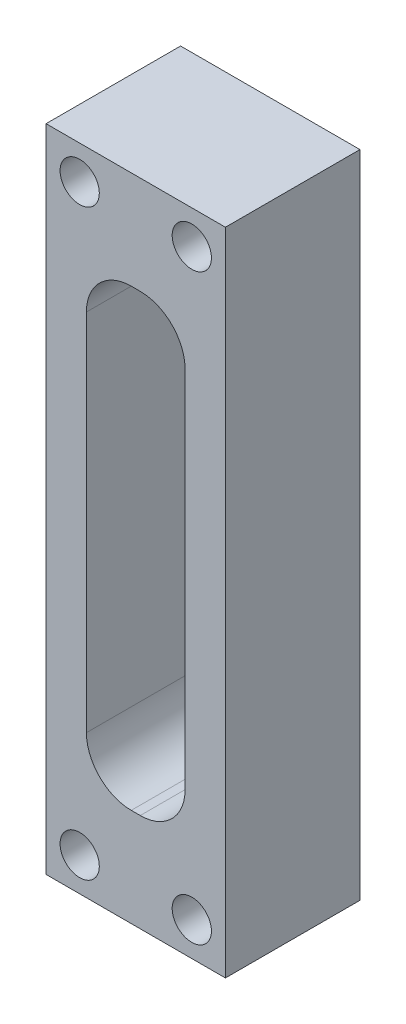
ISO-10303-21;
HEADER;
FILE_DESCRIPTION(('STEP AP214'),'2;1');
FILE_NAME('part.step','',(''),(''),'','','');
FILE_SCHEMA(('AUTOMOTIVE_DESIGN { 1 0 10303 214 1 1 1 1 }'));
ENDSEC;
DATA;
#1=APPLICATION_CONTEXT('core data for automotive mechanical design processes');
#2=APPLICATION_PROTOCOL_DEFINITION('international standard','automotive_design',2000,#1);
#3=PRODUCT_CONTEXT('',#1,'mechanical');
#4=PRODUCT('Part','Part','',(#3));
#5=PRODUCT_RELATED_PRODUCT_CATEGORY('part','',(#4));
#6=PRODUCT_DEFINITION_FORMATION('','',#4);
#7=PRODUCT_DEFINITION_CONTEXT('part definition',#1,'design');
#8=PRODUCT_DEFINITION('design','',#6,#7);
#9=PRODUCT_DEFINITION_SHAPE('','',#8);
#10=(LENGTH_UNIT() NAMED_UNIT(*) SI_UNIT(.MILLI.,.METRE.));
#11=(NAMED_UNIT(*) PLANE_ANGLE_UNIT() SI_UNIT($,.RADIAN.));
#12=(NAMED_UNIT(*) SI_UNIT($,.STERADIAN.) SOLID_ANGLE_UNIT());
#13=UNCERTAINTY_MEASURE_WITH_UNIT(LENGTH_MEASURE(1.E-05),#10,'distance_accuracy_value','');
#14=(GEOMETRIC_REPRESENTATION_CONTEXT(3) GLOBAL_UNCERTAINTY_ASSIGNED_CONTEXT((#13)) GLOBAL_UNIT_ASSIGNED_CONTEXT((#10,
#11,#12)) REPRESENTATION_CONTEXT('',''));
#15=CARTESIAN_POINT('',(0.,0.,0.));
#16=DIRECTION('',(0.,0.,1.));
#17=DIRECTION('',(1.,0.,0.));
#18=AXIS2_PLACEMENT_3D('',#15,#16,#17);
#19=CARTESIAN_POINT('',(-12.7,-46.0375,9.525));
#20=DIRECTION('',(0.,0.,1.));
#21=DIRECTION('',(1.,0.,0.));
#22=AXIS2_PLACEMENT_3D('',#19,#20,#21);
#23=PLANE('',#22);
#24=CARTESIAN_POINT('',(-7.93749999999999,41.275,9.525));
#25=DIRECTION('',(0.,0.,1.));
#26=DIRECTION('',(1.,0.,0.));
#27=AXIS2_PLACEMENT_3D('',#24,#25,#26);
#28=CIRCLE('',#27,2.778125);
#29=CARTESIAN_POINT('',(-5.159375,41.275,9.525));
#30=VERTEX_POINT('',#29);
#31=EDGE_CURVE('E306',#30,#30,#28,.T.);
#32=ORIENTED_EDGE('',*,*,#31,.F.);
#33=EDGE_LOOP('',(#32));
#34=FACE_BOUND('',#33,.T.);
#35=CARTESIAN_POINT('',(7.93750000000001,41.275,9.525));
#36=DIRECTION('',(0.,0.,1.));
#37=DIRECTION('',(1.,0.,0.));
#38=AXIS2_PLACEMENT_3D('',#35,#36,#37);
#39=CIRCLE('',#38,2.778125);
#40=CARTESIAN_POINT('',(10.715625,41.275,9.525));
#41=VERTEX_POINT('',#40);
#42=EDGE_CURVE('E310',#41,#41,#39,.T.);
#43=ORIENTED_EDGE('',*,*,#42,.F.);
#44=EDGE_LOOP('',(#43));
#45=FACE_BOUND('',#44,.T.);
#46=CARTESIAN_POINT('',(7.93750000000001,-41.275,9.525));
#47=DIRECTION('',(0.,0.,1.));
#48=DIRECTION('',(1.,0.,0.));
#49=AXIS2_PLACEMENT_3D('',#46,#47,#48);
#50=CIRCLE('',#49,2.778125);
#51=CARTESIAN_POINT('',(10.715625,-41.275,9.525));
#52=VERTEX_POINT('',#51);
#53=EDGE_CURVE('E319',#52,#52,#50,.T.);
#54=ORIENTED_EDGE('',*,*,#53,.F.);
#55=EDGE_LOOP('',(#54));
#56=FACE_BOUND('',#55,.T.);
#57=CARTESIAN_POINT('',(-7.93749999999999,-41.275,9.525));
#58=DIRECTION('',(0.,0.,1.));
#59=DIRECTION('',(1.,0.,0.));
#60=AXIS2_PLACEMENT_3D('',#57,#58,#59);
#61=CIRCLE('',#60,2.778125);
#62=CARTESIAN_POINT('',(-5.159375,-41.275,9.525));
#63=VERTEX_POINT('',#62);
#64=EDGE_CURVE('E144',#63,#63,#61,.T.);
#65=ORIENTED_EDGE('',*,*,#64,.F.);
#66=EDGE_LOOP('',(#65));
#67=FACE_BOUND('',#66,.T.);
#68=DIRECTION('',(0.,-1.,0.));
#69=VECTOR('',#68,1.);
#70=CARTESIAN_POINT('',(-12.7,46.0375,9.525));
#71=LINE('',#70,#69);
#72=CARTESIAN_POINT('',(-12.7,46.0375,9.525));
#73=VERTEX_POINT('',#72);
#74=CARTESIAN_POINT('',(-12.7,-46.0375,9.525));
#75=VERTEX_POINT('',#74);
#76=EDGE_CURVE('E199',#73,#75,#71,.T.);
#77=ORIENTED_EDGE('',*,*,#76,.T.);
#78=DIRECTION('',(1.,0.,0.));
#79=VECTOR('',#78,1.);
#80=CARTESIAN_POINT('',(-12.7,-46.0375,9.525));
#81=LINE('',#80,#79);
#82=CARTESIAN_POINT('',(12.7,-46.0375,9.525));
#83=VERTEX_POINT('',#82);
#84=EDGE_CURVE('E202',#75,#83,#81,.T.);
#85=ORIENTED_EDGE('',*,*,#84,.T.);
#86=DIRECTION('',(0.,1.,0.));
#87=VECTOR('',#86,1.);
#88=CARTESIAN_POINT('',(12.7,46.0375,9.525));
#89=LINE('',#88,#87);
#90=CARTESIAN_POINT('',(12.7,46.0375,9.525));
#91=VERTEX_POINT('',#90);
#92=EDGE_CURVE('E204',#83,#91,#89,.T.);
#93=ORIENTED_EDGE('',*,*,#92,.T.);
#94=DIRECTION('',(-1.,0.,0.));
#95=VECTOR('',#94,1.);
#96=CARTESIAN_POINT('',(-12.7,46.0375,9.525));
#97=LINE('',#96,#95);
#98=EDGE_CURVE('E206',#91,#73,#97,.T.);
#99=ORIENTED_EDGE('',*,*,#98,.T.);
#100=EDGE_LOOP('',(#77,#85,#93,#99));
#101=FACE_BOUND('',#100,.T.);
#102=DIRECTION('',(0.,-1.,0.));
#103=VECTOR('',#102,1.);
#104=CARTESIAN_POINT('',(-6.985,25.7937,9.525));
#105=LINE('',#104,#103);
#106=CARTESIAN_POINT('',(-6.985,25.7937,9.525));
#107=VERTEX_POINT('',#106);
#108=CARTESIAN_POINT('',(-6.985,-25.7937,9.525));
#109=VERTEX_POINT('',#108);
#110=EDGE_CURVE('E165',#107,#109,#105,.T.);
#111=ORIENTED_EDGE('',*,*,#110,.F.);
#112=CARTESIAN_POINT('',(-0.635000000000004,25.7937,9.525));
#113=DIRECTION('',(0.,0.,1.));
#114=DIRECTION('',(-1.,0.,0.));
#115=AXIS2_PLACEMENT_3D('',#112,#113,#114);
#116=CIRCLE('',#115,6.35);
#117=CARTESIAN_POINT('',(-0.635000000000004,32.1437,9.525));
#118=VERTEX_POINT('',#117);
#119=EDGE_CURVE('E137',#118,#107,#116,.T.);
#120=ORIENTED_EDGE('',*,*,#119,.F.);
#121=DIRECTION('',(-1.,0.,0.));
#122=VECTOR('',#121,1.);
#123=CARTESIAN_POINT('',(-0.635000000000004,32.1437,9.525));
#124=LINE('',#123,#122);
#125=CARTESIAN_POINT('',(0.634999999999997,32.1437,9.525));
#126=VERTEX_POINT('',#125);
#127=EDGE_CURVE('E177',#126,#118,#124,.T.);
#128=ORIENTED_EDGE('',*,*,#127,.F.);
#129=CARTESIAN_POINT('',(0.634999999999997,25.7937,9.525));
#130=DIRECTION('',(0.,0.,1.));
#131=DIRECTION('',(1.,0.,0.));
#132=AXIS2_PLACEMENT_3D('',#129,#130,#131);
#133=CIRCLE('',#132,6.35);
#134=CARTESIAN_POINT('',(6.985,25.7937,9.525));
#135=VERTEX_POINT('',#134);
#136=EDGE_CURVE('E175',#135,#126,#133,.T.);
#137=ORIENTED_EDGE('',*,*,#136,.F.);
#138=DIRECTION('',(0.,1.,0.));
#139=VECTOR('',#138,1.);
#140=CARTESIAN_POINT('',(6.985,25.7937,9.525));
#141=LINE('',#140,#139);
#142=CARTESIAN_POINT('',(6.985,-25.7937,9.525));
#143=VERTEX_POINT('',#142);
#144=EDGE_CURVE('E173',#143,#135,#141,.T.);
#145=ORIENTED_EDGE('',*,*,#144,.F.);
#146=CARTESIAN_POINT('',(0.635000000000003,-25.7937,9.525));
#147=DIRECTION('',(0.,0.,1.));
#148=DIRECTION('',(1.,0.,0.));
#149=AXIS2_PLACEMENT_3D('',#146,#147,#148);
#150=CIRCLE('',#149,6.35);
#151=CARTESIAN_POINT('',(0.635000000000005,-32.1437,9.525));
#152=VERTEX_POINT('',#151);
#153=EDGE_CURVE('E171',#152,#143,#150,.T.);
#154=ORIENTED_EDGE('',*,*,#153,.F.);
#155=DIRECTION('',(1.,0.,0.));
#156=VECTOR('',#155,1.);
#157=CARTESIAN_POINT('',(-0.634999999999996,-32.1437,9.525));
#158=LINE('',#157,#156);
#159=CARTESIAN_POINT('',(-0.634999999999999,-32.1437,9.525));
#160=VERTEX_POINT('',#159);
#161=EDGE_CURVE('E169',#160,#152,#158,.T.);
#162=ORIENTED_EDGE('',*,*,#161,.F.);
#163=CARTESIAN_POINT('',(-0.634999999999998,-25.7937,9.525));
#164=DIRECTION('',(0.,0.,1.));
#165=DIRECTION('',(1.,0.,0.));
#166=AXIS2_PLACEMENT_3D('',#163,#164,#165);
#167=CIRCLE('',#166,6.35);
#168=EDGE_CURVE('E167',#109,#160,#167,.T.);
#169=ORIENTED_EDGE('',*,*,#168,.F.);
#170=EDGE_LOOP('',(#111,#120,#128,#137,#145,#154,#162,#169));
#171=FACE_BOUND('',#170,.T.);
#172=ADVANCED_FACE('F33',(#34,#45,#56,#67,#101,#171),#23,.T.);
#173=CARTESIAN_POINT('',(-12.7,-46.0375,-9.525));
#174=DIRECTION('',(0.,0.,1.));
#175=DIRECTION('',(1.,0.,0.));
#176=AXIS2_PLACEMENT_3D('',#173,#174,#175);
#177=PLANE('',#176);
#178=CARTESIAN_POINT('',(-7.93749999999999,41.275,-9.525));
#179=DIRECTION('',(0.,0.,1.));
#180=DIRECTION('',(1.,0.,0.));
#181=AXIS2_PLACEMENT_3D('',#178,#179,#180);
#182=CIRCLE('',#181,2.778125);
#183=CARTESIAN_POINT('',(-5.159375,41.275,-9.525));
#184=VERTEX_POINT('',#183);
#185=EDGE_CURVE('E304',#184,#184,#182,.T.);
#186=ORIENTED_EDGE('',*,*,#185,.T.);
#187=EDGE_LOOP('',(#186));
#188=FACE_BOUND('',#187,.T.);
#189=CARTESIAN_POINT('',(7.93750000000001,41.275,-9.525));
#190=DIRECTION('',(0.,0.,1.));
#191=DIRECTION('',(1.,0.,0.));
#192=AXIS2_PLACEMENT_3D('',#189,#190,#191);
#193=CIRCLE('',#192,2.778125);
#194=CARTESIAN_POINT('',(10.715625,41.275,-9.525));
#195=VERTEX_POINT('',#194);
#196=EDGE_CURVE('E307',#195,#195,#193,.T.);
#197=ORIENTED_EDGE('',*,*,#196,.T.);
#198=EDGE_LOOP('',(#197));
#199=FACE_BOUND('',#198,.T.);
#200=CARTESIAN_POINT('',(7.93750000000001,-41.275,-9.525));
#201=DIRECTION('',(0.,0.,1.));
#202=DIRECTION('',(1.,0.,0.));
#203=AXIS2_PLACEMENT_3D('',#200,#201,#202);
#204=CIRCLE('',#203,2.778125);
#205=CARTESIAN_POINT('',(10.715625,-41.275,-9.525));
#206=VERTEX_POINT('',#205);
#207=EDGE_CURVE('E316',#206,#206,#204,.T.);
#208=ORIENTED_EDGE('',*,*,#207,.T.);
#209=EDGE_LOOP('',(#208));
#210=FACE_BOUND('',#209,.T.);
#211=CARTESIAN_POINT('',(-7.93749999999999,-41.275,-9.525));
#212=DIRECTION('',(0.,0.,1.));
#213=DIRECTION('',(1.,0.,0.));
#214=AXIS2_PLACEMENT_3D('',#211,#212,#213);
#215=CIRCLE('',#214,2.778125);
#216=CARTESIAN_POINT('',(-5.159375,-41.275,-9.525));
#217=VERTEX_POINT('',#216);
#218=EDGE_CURVE('E147',#217,#217,#215,.T.);
#219=ORIENTED_EDGE('',*,*,#218,.T.);
#220=EDGE_LOOP('',(#219));
#221=FACE_BOUND('',#220,.T.);
#222=DIRECTION('',(0.,-1.,0.));
#223=VECTOR('',#222,1.);
#224=CARTESIAN_POINT('',(-12.7,46.0375,-9.525));
#225=LINE('',#224,#223);
#226=CARTESIAN_POINT('',(-12.7,46.0375,-9.525));
#227=VERTEX_POINT('',#226);
#228=CARTESIAN_POINT('',(-12.7,-46.0375,-9.525));
#229=VERTEX_POINT('',#228);
#230=EDGE_CURVE('E138',#227,#229,#225,.T.);
#231=ORIENTED_EDGE('',*,*,#230,.F.);
#232=DIRECTION('',(-1.,0.,0.));
#233=VECTOR('',#232,1.);
#234=CARTESIAN_POINT('',(-12.7,46.0375,-9.525));
#235=LINE('',#234,#233);
#236=CARTESIAN_POINT('',(12.7,46.0375,-9.525));
#237=VERTEX_POINT('',#236);
#238=EDGE_CURVE('E197',#237,#227,#235,.T.);
#239=ORIENTED_EDGE('',*,*,#238,.F.);
#240=DIRECTION('',(0.,1.,0.));
#241=VECTOR('',#240,1.);
#242=CARTESIAN_POINT('',(12.7,46.0375,-9.525));
#243=LINE('',#242,#241);
#244=CARTESIAN_POINT('',(12.7,-46.0375,-9.525));
#245=VERTEX_POINT('',#244);
#246=EDGE_CURVE('E195',#245,#237,#243,.T.);
#247=ORIENTED_EDGE('',*,*,#246,.F.);
#248=DIRECTION('',(1.,0.,0.));
#249=VECTOR('',#248,1.);
#250=CARTESIAN_POINT('',(-12.7,-46.0375,-9.525));
#251=LINE('',#250,#249);
#252=EDGE_CURVE('E193',#229,#245,#251,.T.);
#253=ORIENTED_EDGE('',*,*,#252,.F.);
#254=EDGE_LOOP('',(#231,#239,#247,#253));
#255=FACE_BOUND('',#254,.T.);
#256=CARTESIAN_POINT('',(-0.635000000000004,25.7937,-9.525));
#257=DIRECTION('',(0.,0.,1.));
#258=DIRECTION('',(-1.,0.,0.));
#259=AXIS2_PLACEMENT_3D('',#256,#257,#258);
#260=CIRCLE('',#259,6.35);
#261=CARTESIAN_POINT('',(-0.635000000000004,32.1437,-9.525));
#262=VERTEX_POINT('',#261);
#263=CARTESIAN_POINT('',(-6.985,25.7937,-9.525));
#264=VERTEX_POINT('',#263);
#265=EDGE_CURVE('E56',#262,#264,#260,.T.);
#266=ORIENTED_EDGE('',*,*,#265,.T.);
#267=DIRECTION('',(0.,-1.,0.));
#268=VECTOR('',#267,1.);
#269=CARTESIAN_POINT('',(-6.985,25.7937,-9.525));
#270=LINE('',#269,#268);
#271=CARTESIAN_POINT('',(-6.985,-25.7937,-9.525));
#272=VERTEX_POINT('',#271);
#273=EDGE_CURVE('E124',#264,#272,#270,.T.);
#274=ORIENTED_EDGE('',*,*,#273,.T.);
#275=CARTESIAN_POINT('',(-0.634999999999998,-25.7937,-9.525));
#276=DIRECTION('',(0.,0.,1.));
#277=DIRECTION('',(1.,0.,0.));
#278=AXIS2_PLACEMENT_3D('',#275,#276,#277);
#279=CIRCLE('',#278,6.35);
#280=CARTESIAN_POINT('',(-0.634999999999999,-32.1437,-9.525));
#281=VERTEX_POINT('',#280);
#282=EDGE_CURVE('E133',#272,#281,#279,.T.);
#283=ORIENTED_EDGE('',*,*,#282,.T.);
#284=DIRECTION('',(1.,0.,0.));
#285=VECTOR('',#284,1.);
#286=CARTESIAN_POINT('',(-0.634999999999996,-32.1437,-9.525));
#287=LINE('',#286,#285);
#288=CARTESIAN_POINT('',(0.635000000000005,-32.1437,-9.525));
#289=VERTEX_POINT('',#288);
#290=EDGE_CURVE('E152',#281,#289,#287,.T.);
#291=ORIENTED_EDGE('',*,*,#290,.T.);
#292=CARTESIAN_POINT('',(0.635000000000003,-25.7937,-9.525));
#293=DIRECTION('',(0.,0.,1.));
#294=DIRECTION('',(1.,0.,0.));
#295=AXIS2_PLACEMENT_3D('',#292,#293,#294);
#296=CIRCLE('',#295,6.35);
#297=CARTESIAN_POINT('',(6.985,-25.7937,-9.525));
#298=VERTEX_POINT('',#297);
#299=EDGE_CURVE('E155',#289,#298,#296,.T.);
#300=ORIENTED_EDGE('',*,*,#299,.T.);
#301=DIRECTION('',(0.,1.,0.));
#302=VECTOR('',#301,1.);
#303=CARTESIAN_POINT('',(6.985,25.7937,-9.525));
#304=LINE('',#303,#302);
#305=CARTESIAN_POINT('',(6.985,25.7937,-9.525));
#306=VERTEX_POINT('',#305);
#307=EDGE_CURVE('E158',#298,#306,#304,.T.);
#308=ORIENTED_EDGE('',*,*,#307,.T.);
#309=CARTESIAN_POINT('',(0.634999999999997,25.7937,-9.525));
#310=DIRECTION('',(0.,0.,1.));
#311=DIRECTION('',(1.,0.,0.));
#312=AXIS2_PLACEMENT_3D('',#309,#310,#311);
#313=CIRCLE('',#312,6.35);
#314=CARTESIAN_POINT('',(0.634999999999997,32.1437,-9.525));
#315=VERTEX_POINT('',#314);
#316=EDGE_CURVE('E161',#306,#315,#313,.T.);
#317=ORIENTED_EDGE('',*,*,#316,.T.);
#318=DIRECTION('',(-1.,0.,0.));
#319=VECTOR('',#318,1.);
#320=CARTESIAN_POINT('',(-0.635000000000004,32.1437,-9.525));
#321=LINE('',#320,#319);
#322=EDGE_CURVE('E143',#315,#262,#321,.T.);
#323=ORIENTED_EDGE('',*,*,#322,.T.);
#324=EDGE_LOOP('',(#266,#274,#283,#291,#300,#308,#317,#323));
#325=FACE_BOUND('',#324,.T.);
#326=ADVANCED_FACE('F141',(#188,#199,#210,#221,#255,#325),#177,.F.);
#327=CARTESIAN_POINT('',(-12.7,46.0375,9.525));
#328=DIRECTION('',(1.,0.,0.));
#329=DIRECTION('',(0.,1.,0.));
#330=AXIS2_PLACEMENT_3D('',#327,#328,#329);
#331=PLANE('',#330);
#332=ORIENTED_EDGE('',*,*,#230,.T.);
#333=DIRECTION('',(0.,0.,-1.));
#334=VECTOR('',#333,1.);
#335=CARTESIAN_POINT('',(-12.7,-46.0375,9.525));
#336=LINE('',#335,#334);
#337=EDGE_CURVE('E11',#75,#229,#336,.T.);
#338=ORIENTED_EDGE('',*,*,#337,.F.);
#339=ORIENTED_EDGE('',*,*,#76,.F.);
#340=DIRECTION('',(0.,0.,-1.));
#341=VECTOR('',#340,1.);
#342=CARTESIAN_POINT('',(-12.7,46.0375,9.525));
#343=LINE('',#342,#341);
#344=EDGE_CURVE('E208',#73,#227,#343,.T.);
#345=ORIENTED_EDGE('',*,*,#344,.T.);
#346=EDGE_LOOP('',(#332,#338,#339,#345));
#347=FACE_BOUND('',#346,.T.);
#348=ADVANCED_FACE('F35',(#347),#331,.F.);
#349=CARTESIAN_POINT('',(-12.7,-46.0375,9.525));
#350=DIRECTION('',(0.,1.,0.));
#351=DIRECTION('',(0.,0.,1.));
#352=AXIS2_PLACEMENT_3D('',#349,#350,#351);
#353=PLANE('',#352);
#354=ORIENTED_EDGE('',*,*,#252,.T.);
#355=DIRECTION('',(0.,0.,-1.));
#356=VECTOR('',#355,1.);
#357=CARTESIAN_POINT('',(12.7,-46.0375,9.525));
#358=LINE('',#357,#356);
#359=EDGE_CURVE('E41',#83,#245,#358,.T.);
#360=ORIENTED_EDGE('',*,*,#359,.F.);
#361=ORIENTED_EDGE('',*,*,#84,.F.);
#362=ORIENTED_EDGE('',*,*,#337,.T.);
#363=EDGE_LOOP('',(#354,#360,#361,#362));
#364=FACE_BOUND('',#363,.T.);
#365=ADVANCED_FACE('F233',(#364),#353,.F.);
#366=CARTESIAN_POINT('',(12.7,46.0375,9.525));
#367=DIRECTION('',(-1.,0.,0.));
#368=DIRECTION('',(0.,-1.,0.));
#369=AXIS2_PLACEMENT_3D('',#366,#367,#368);
#370=PLANE('',#369);
#371=ORIENTED_EDGE('',*,*,#246,.T.);
#372=DIRECTION('',(0.,0.,-1.));
#373=VECTOR('',#372,1.);
#374=CARTESIAN_POINT('',(12.7,46.0375,9.525));
#375=LINE('',#374,#373);
#376=EDGE_CURVE('E211',#91,#237,#375,.T.);
#377=ORIENTED_EDGE('',*,*,#376,.F.);
#378=ORIENTED_EDGE('',*,*,#92,.F.);
#379=ORIENTED_EDGE('',*,*,#359,.T.);
#380=EDGE_LOOP('',(#371,#377,#378,#379));
#381=FACE_BOUND('',#380,.T.);
#382=ADVANCED_FACE('F218',(#381),#370,.F.);
#383=CARTESIAN_POINT('',(-12.7,46.0375,9.525));
#384=DIRECTION('',(0.,-1.,0.));
#385=DIRECTION('',(0.,0.,-1.));
#386=AXIS2_PLACEMENT_3D('',#383,#384,#385);
#387=PLANE('',#386);
#388=ORIENTED_EDGE('',*,*,#238,.T.);
#389=ORIENTED_EDGE('',*,*,#344,.F.);
#390=ORIENTED_EDGE('',*,*,#98,.F.);
#391=ORIENTED_EDGE('',*,*,#376,.T.);
#392=EDGE_LOOP('',(#388,#389,#390,#391));
#393=FACE_BOUND('',#392,.T.);
#394=ADVANCED_FACE('F226',(#393),#387,.F.);
#395=CARTESIAN_POINT('',(-0.635000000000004,25.7937,9.525));
#396=DIRECTION('',(0.,0.,-1.));
#397=DIRECTION('',(-1.,0.,0.));
#398=AXIS2_PLACEMENT_3D('',#395,#396,#397);
#399=CYLINDRICAL_SURFACE('',#398,6.35);
#400=ORIENTED_EDGE('',*,*,#265,.F.);
#401=DIRECTION('',(0.,0.,-1.));
#402=VECTOR('',#401,1.);
#403=CARTESIAN_POINT('',(-0.635000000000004,32.1437,9.525));
#404=LINE('',#403,#402);
#405=EDGE_CURVE('E179',#118,#262,#404,.T.);
#406=ORIENTED_EDGE('',*,*,#405,.F.);
#407=ORIENTED_EDGE('',*,*,#119,.T.);
#408=DIRECTION('',(0.,0.,-1.));
#409=VECTOR('',#408,1.);
#410=CARTESIAN_POINT('',(-6.985,25.7937,9.525));
#411=LINE('',#410,#409);
#412=EDGE_CURVE('E126',#107,#264,#411,.T.);
#413=ORIENTED_EDGE('',*,*,#412,.T.);
#414=EDGE_LOOP('',(#400,#406,#407,#413));
#415=FACE_BOUND('',#414,.T.);
#416=ADVANCED_FACE('F135',(#415),#399,.F.);
#417=CARTESIAN_POINT('',(-6.985,25.7937,9.525));
#418=DIRECTION('',(1.,0.,0.));
#419=DIRECTION('',(0.,1.,0.));
#420=AXIS2_PLACEMENT_3D('',#417,#418,#419);
#421=PLANE('',#420);
#422=ORIENTED_EDGE('',*,*,#273,.F.);
#423=ORIENTED_EDGE('',*,*,#412,.F.);
#424=ORIENTED_EDGE('',*,*,#110,.T.);
#425=DIRECTION('',(0.,0.,-1.));
#426=VECTOR('',#425,1.);
#427=CARTESIAN_POINT('',(-6.985,-25.7937,9.525));
#428=LINE('',#427,#426);
#429=EDGE_CURVE('E129',#109,#272,#428,.T.);
#430=ORIENTED_EDGE('',*,*,#429,.T.);
#431=EDGE_LOOP('',(#422,#423,#424,#430));
#432=FACE_BOUND('',#431,.T.);
#433=ADVANCED_FACE('F125',(#432),#421,.T.);
#434=CARTESIAN_POINT('',(-0.634999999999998,-25.7937,9.525));
#435=DIRECTION('',(0.,0.,-1.));
#436=DIRECTION('',(-1.,0.,0.));
#437=AXIS2_PLACEMENT_3D('',#434,#435,#436);
#438=CYLINDRICAL_SURFACE('',#437,6.35);
#439=ORIENTED_EDGE('',*,*,#282,.F.);
#440=ORIENTED_EDGE('',*,*,#429,.F.);
#441=ORIENTED_EDGE('',*,*,#168,.T.);
#442=DIRECTION('',(0.,0.,-1.));
#443=VECTOR('',#442,1.);
#444=CARTESIAN_POINT('',(-0.634999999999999,-32.1437,9.525));
#445=LINE('',#444,#443);
#446=EDGE_CURVE('E188',#160,#281,#445,.T.);
#447=ORIENTED_EDGE('',*,*,#446,.T.);
#448=EDGE_LOOP('',(#439,#440,#441,#447));
#449=FACE_BOUND('',#448,.T.);
#450=ADVANCED_FACE('F259',(#449),#438,.F.);
#451=CARTESIAN_POINT('',(-0.634999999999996,-32.1437,9.525));
#452=DIRECTION('',(0.,1.,0.));
#453=DIRECTION('',(0.,0.,1.));
#454=AXIS2_PLACEMENT_3D('',#451,#452,#453);
#455=PLANE('',#454);
#456=ORIENTED_EDGE('',*,*,#290,.F.);
#457=ORIENTED_EDGE('',*,*,#446,.F.);
#458=ORIENTED_EDGE('',*,*,#161,.T.);
#459=DIRECTION('',(0.,0.,-1.));
#460=VECTOR('',#459,1.);
#461=CARTESIAN_POINT('',(0.635000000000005,-32.1437,9.525));
#462=LINE('',#461,#460);
#463=EDGE_CURVE('E186',#152,#289,#462,.T.);
#464=ORIENTED_EDGE('',*,*,#463,.T.);
#465=EDGE_LOOP('',(#456,#457,#458,#464));
#466=FACE_BOUND('',#465,.T.);
#467=ADVANCED_FACE('F264',(#466),#455,.T.);
#468=CARTESIAN_POINT('',(0.635000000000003,-25.7937,9.525));
#469=DIRECTION('',(0.,0.,-1.));
#470=DIRECTION('',(-1.,0.,0.));
#471=AXIS2_PLACEMENT_3D('',#468,#469,#470);
#472=CYLINDRICAL_SURFACE('',#471,6.35);
#473=ORIENTED_EDGE('',*,*,#299,.F.);
#474=ORIENTED_EDGE('',*,*,#463,.F.);
#475=ORIENTED_EDGE('',*,*,#153,.T.);
#476=DIRECTION('',(0.,0.,-1.));
#477=VECTOR('',#476,1.);
#478=CARTESIAN_POINT('',(6.985,-25.7937,9.525));
#479=LINE('',#478,#477);
#480=EDGE_CURVE('E184',#143,#298,#479,.T.);
#481=ORIENTED_EDGE('',*,*,#480,.T.);
#482=EDGE_LOOP('',(#473,#474,#475,#481));
#483=FACE_BOUND('',#482,.T.);
#484=ADVANCED_FACE('F268',(#483),#472,.F.);
#485=CARTESIAN_POINT('',(6.985,25.7937,9.525));
#486=DIRECTION('',(-1.,0.,0.));
#487=DIRECTION('',(0.,-1.,0.));
#488=AXIS2_PLACEMENT_3D('',#485,#486,#487);
#489=PLANE('',#488);
#490=ORIENTED_EDGE('',*,*,#307,.F.);
#491=ORIENTED_EDGE('',*,*,#480,.F.);
#492=ORIENTED_EDGE('',*,*,#144,.T.);
#493=DIRECTION('',(0.,0.,-1.));
#494=VECTOR('',#493,1.);
#495=CARTESIAN_POINT('',(6.985,25.7937,9.525));
#496=LINE('',#495,#494);
#497=EDGE_CURVE('E182',#135,#306,#496,.T.);
#498=ORIENTED_EDGE('',*,*,#497,.T.);
#499=EDGE_LOOP('',(#490,#491,#492,#498));
#500=FACE_BOUND('',#499,.T.);
#501=ADVANCED_FACE('F272',(#500),#489,.T.);
#502=CARTESIAN_POINT('',(0.634999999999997,25.7937,9.525));
#503=DIRECTION('',(0.,0.,-1.));
#504=DIRECTION('',(-1.,0.,0.));
#505=AXIS2_PLACEMENT_3D('',#502,#503,#504);
#506=CYLINDRICAL_SURFACE('',#505,6.35);
#507=ORIENTED_EDGE('',*,*,#316,.F.);
#508=ORIENTED_EDGE('',*,*,#497,.F.);
#509=ORIENTED_EDGE('',*,*,#136,.T.);
#510=DIRECTION('',(0.,0.,-1.));
#511=VECTOR('',#510,1.);
#512=CARTESIAN_POINT('',(0.634999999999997,32.1437,9.525));
#513=LINE('',#512,#511);
#514=EDGE_CURVE('E48',#126,#315,#513,.T.);
#515=ORIENTED_EDGE('',*,*,#514,.T.);
#516=EDGE_LOOP('',(#507,#508,#509,#515));
#517=FACE_BOUND('',#516,.T.);
#518=ADVANCED_FACE('F276',(#517),#506,.F.);
#519=CARTESIAN_POINT('',(-0.635000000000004,32.1437,9.525));
#520=DIRECTION('',(0.,-1.,0.));
#521=DIRECTION('',(0.,0.,-1.));
#522=AXIS2_PLACEMENT_3D('',#519,#520,#521);
#523=PLANE('',#522);
#524=ORIENTED_EDGE('',*,*,#322,.F.);
#525=ORIENTED_EDGE('',*,*,#514,.F.);
#526=ORIENTED_EDGE('',*,*,#127,.T.);
#527=ORIENTED_EDGE('',*,*,#405,.T.);
#528=EDGE_LOOP('',(#524,#525,#526,#527));
#529=FACE_BOUND('',#528,.T.);
#530=ADVANCED_FACE('F280',(#529),#523,.T.);
#531=CARTESIAN_POINT('',(-7.93749999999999,-41.275,9.525));
#532=DIRECTION('',(0.,0.,1.));
#533=DIRECTION('',(1.,0.,0.));
#534=AXIS2_PLACEMENT_3D('',#531,#532,#533);
#535=CYLINDRICAL_SURFACE('',#534,2.778125);
#536=ORIENTED_EDGE('',*,*,#218,.F.);
#537=EDGE_LOOP('',(#536));
#538=FACE_BOUND('',#537,.T.);
#539=ORIENTED_EDGE('',*,*,#64,.T.);
#540=EDGE_LOOP('',(#539));
#541=FACE_BOUND('',#540,.T.);
#542=ADVANCED_FACE('F284',(#538,#541),#535,.F.);
#543=CARTESIAN_POINT('',(7.93750000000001,-41.275,9.525));
#544=DIRECTION('',(0.,0.,1.));
#545=DIRECTION('',(1.,0.,0.));
#546=AXIS2_PLACEMENT_3D('',#543,#544,#545);
#547=CYLINDRICAL_SURFACE('',#546,2.778125);
#548=ORIENTED_EDGE('',*,*,#207,.F.);
#549=EDGE_LOOP('',(#548));
#550=FACE_BOUND('',#549,.T.);
#551=ORIENTED_EDGE('',*,*,#53,.T.);
#552=EDGE_LOOP('',(#551));
#553=FACE_BOUND('',#552,.T.);
#554=ADVANCED_FACE('F287',(#550,#553),#547,.F.);
#555=CARTESIAN_POINT('',(7.93750000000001,41.275,9.525));
#556=DIRECTION('',(0.,0.,1.));
#557=DIRECTION('',(1.,0.,0.));
#558=AXIS2_PLACEMENT_3D('',#555,#556,#557);
#559=CYLINDRICAL_SURFACE('',#558,2.778125);
#560=ORIENTED_EDGE('',*,*,#196,.F.);
#561=EDGE_LOOP('',(#560));
#562=FACE_BOUND('',#561,.T.);
#563=ORIENTED_EDGE('',*,*,#42,.T.);
#564=EDGE_LOOP('',(#563));
#565=FACE_BOUND('',#564,.T.);
#566=ADVANCED_FACE('F291',(#562,#565),#559,.F.);
#567=CARTESIAN_POINT('',(-7.93749999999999,41.275,9.525));
#568=DIRECTION('',(0.,0.,1.));
#569=DIRECTION('',(1.,0.,0.));
#570=AXIS2_PLACEMENT_3D('',#567,#568,#569);
#571=CYLINDRICAL_SURFACE('',#570,2.778125);
#572=ORIENTED_EDGE('',*,*,#185,.F.);
#573=EDGE_LOOP('',(#572));
#574=FACE_BOUND('',#573,.T.);
#575=ORIENTED_EDGE('',*,*,#31,.T.);
#576=EDGE_LOOP('',(#575));
#577=FACE_BOUND('',#576,.T.);
#578=ADVANCED_FACE('F295',(#574,#577),#571,.F.);
#579=CLOSED_SHELL('',(#172,#326,#348,#365,#382,#394,#416,#433,#450,#467,#484,#501,#518,#530,
#542,#554,#566,#578));
#580=MANIFOLD_SOLID_BREP('B2',#579);
#581=ADVANCED_BREP_SHAPE_REPRESENTATION('',(#18,#580),#14);
#582=SHAPE_DEFINITION_REPRESENTATION(#9,#581);
ENDSEC;
END-ISO-10303-21;
